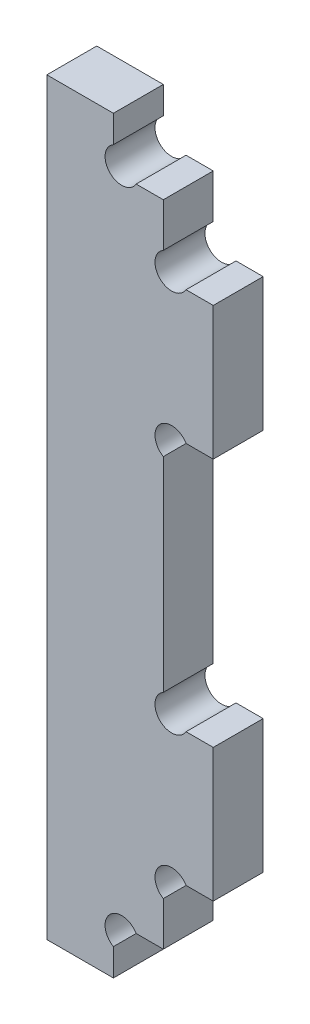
from build123d import *

# Parameters (mm, degrees)
SKETCH_1_W            = 7
SKETCH_1_H            = 39
EXTRUDE_1_DEPTH       = 3
SKETCH_2_W            = 4
SKETCH_2_H            = 3
SKETCH_2_W_2          = 3
SKETCH_2_H_2          = 8
EXTRUDE_2_DEPTH       = 3
HOLE_WIZARD_2_0_2_1_D = 2


with BuildPart() as part:
    # Sketch 1 → Extrude 1 (new body)
    with BuildSketch(Plane.XY):
        Rectangle(SKETCH_1_W, SKETCH_1_H)
    extrude(amount=EXTRUDE_1_DEPTH)

    # Sketch 2 → Extrude 2 (add)
    with BuildSketch(Plane.XY):
        with Locations((-1.5, 21)):
            Rectangle(SKETCH_2_W, SKETCH_2_H)
        with Locations((-1.5, -21)):
            Rectangle(SKETCH_2_W, SKETCH_2_H)
        with Locations((5, -11.5)):
            Rectangle(SKETCH_2_W_2, SKETCH_2_H_2)
        with Locations((5, 11.5)):
            Rectangle(SKETCH_2_W_2, SKETCH_2_H_2)
    extrude(amount=EXTRUDE_2_DEPTH)

    # Hole Wizard 2.0 _2_ _1 (through all)
    with Locations(Plane.XY.offset(3)):
        with Locations((1, 20), (4, 16), (4, 7), (1, -20), (4, -7), (4, -16)):
            Hole(HOLE_WIZARD_2_0_2_1_D / 2)


solid = part.part
